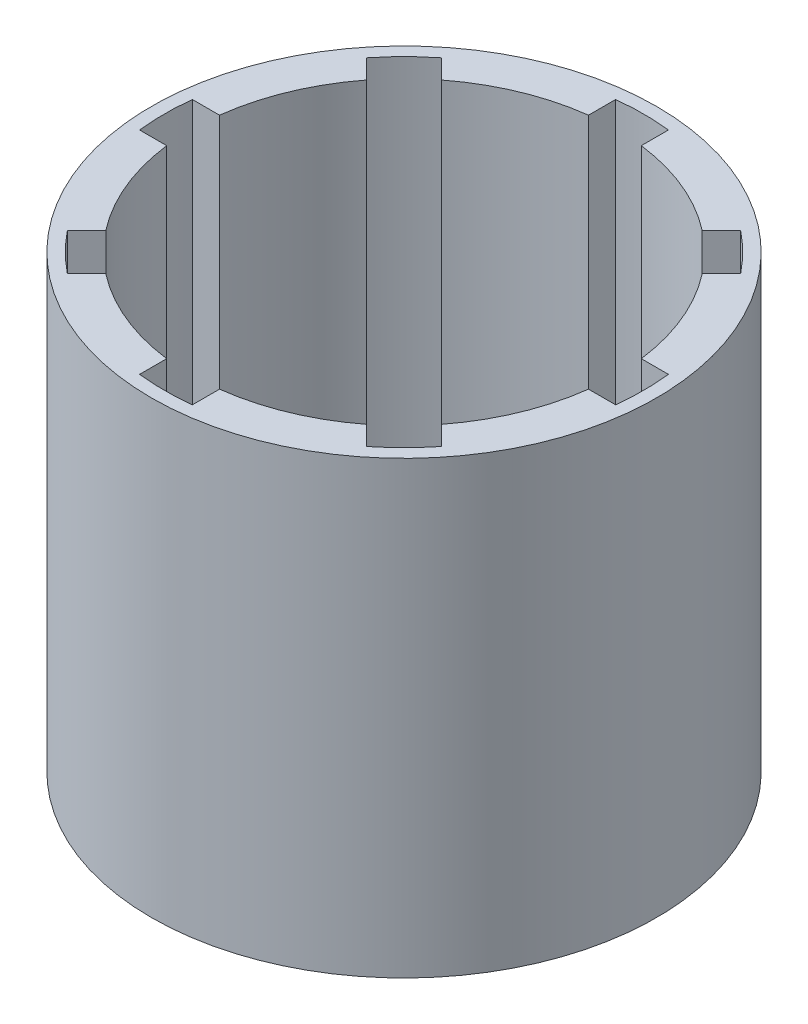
from build123d import *

# Parameters (mm, degrees)
ESQUISSE1_R             = 50.5
ESQUISSE1_R_2           = 42.5
EXTRUSION1_DEPTH        = 90
ENL_V_MAT_EXTRU_1_DEPTH = 90


with BuildPart() as part:
    # Esquisse1 → Extrusion1 (new body)
    with BuildSketch(Plane(origin=(0, 0, 0), x_dir=(1, 0, 0), z_dir=(0, 1, 0))):
        with Locations(Location((0, 0, 0), (0, 0, 90))):
            Circle(ESQUISSE1_R)
        with Locations(Location((0, 0, 0), (0, 0, 90))):
            Circle(ESQUISSE1_R_2, mode=Mode.SUBTRACT)
    extrude(amount=EXTRUSION1_DEPTH)

    # Esquisse2 → Enl_v. mat.-Extru.1 (cut)
    with BuildSketch(Plane(origin=(0, 90, 0), x_dir=(1, 0, 0), z_dir=(0, 1, 0))):
        with BuildLine():
            Line((5.279773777, 47.604517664), (5.279773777, 26.856201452))
            Line((5.279773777, 26.856201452), (-5.279773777, 26.856201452))
            Line((-5.279773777, 26.856201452), (-5.279773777, 47.604517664))
            ThreePointArc((-5.279773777, 47.604517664), (0, 47.896410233), (5.279773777, 47.604517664))
        make_face()
        with BuildLine():
            Line((29.928113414, 37.394841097), (15.256838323, 22.723566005))
            Line((15.256838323, 22.723566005), (22.723566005, 15.256838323))
            Line((22.723566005, 15.256838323), (37.394841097, 29.928113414))
            ThreePointArc((37.394841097, 29.928113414), (33.86787647, 33.86787647), (29.928113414, 37.394841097))
        make_face()
        with BuildLine():
            Line((47.604517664, 5.279773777), (26.856201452, 5.279773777))
            Line((26.856201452, 5.279773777), (26.856201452, -5.279773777))
            Line((26.856201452, -5.279773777), (47.604517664, -5.279773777))
            ThreePointArc((47.604517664, -5.279773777), (47.896410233, 0), (47.604517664, 5.279773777))
        make_face()
        with BuildLine():
            Line((37.394841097, -29.928113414), (22.723566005, -15.256838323))
            Line((22.723566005, -15.256838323), (15.256838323, -22.723566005))
            Line((15.256838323, -22.723566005), (29.928113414, -37.394841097))
            ThreePointArc((29.928113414, -37.394841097), (33.86787647, -33.86787647), (37.394841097, -29.928113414))
        make_face()
        with BuildLine():
            Line((5.279773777, -47.604517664), (5.279773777, -26.856201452))
            Line((5.279773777, -26.856201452), (-5.279773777, -26.856201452))
            Line((-5.279773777, -26.856201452), (-5.279773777, -47.604517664))
            ThreePointArc((-5.279773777, -47.604517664), (0, -47.896410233), (5.279773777, -47.604517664))
        make_face()
        with BuildLine():
            Line((-29.928113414, -37.394841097), (-15.256838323, -22.723566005))
            Line((-15.256838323, -22.723566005), (-22.723566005, -15.256838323))
            Line((-22.723566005, -15.256838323), (-37.394841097, -29.928113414))
            ThreePointArc((-37.394841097, -29.928113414), (-33.86787647, -33.86787647), (-29.928113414, -37.394841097))
        make_face()
        with BuildLine():
            Line((-47.604517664, -5.279773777), (-26.856201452, -5.279773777))
            Line((-26.856201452, -5.279773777), (-26.856201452, 5.279773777))
            Line((-26.856201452, 5.279773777), (-47.604517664, 5.279773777))
            ThreePointArc((-47.604517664, 5.279773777), (-47.896410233, 0), (-47.604517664, -5.279773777))
        make_face()
        with BuildLine():
            Line((-37.394841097, 29.928113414), (-22.723566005, 15.256838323))
            Line((-22.723566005, 15.256838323), (-15.256838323, 22.723566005))
            Line((-15.256838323, 22.723566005), (-29.928113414, 37.394841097))
            ThreePointArc((-29.928113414, 37.394841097), (-33.86787647, 33.86787647), (-37.394841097, 29.928113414))
        make_face()
    extrude(amount=-ENL_V_MAT_EXTRU_1_DEPTH, mode=Mode.SUBTRACT)


solid = part.part
